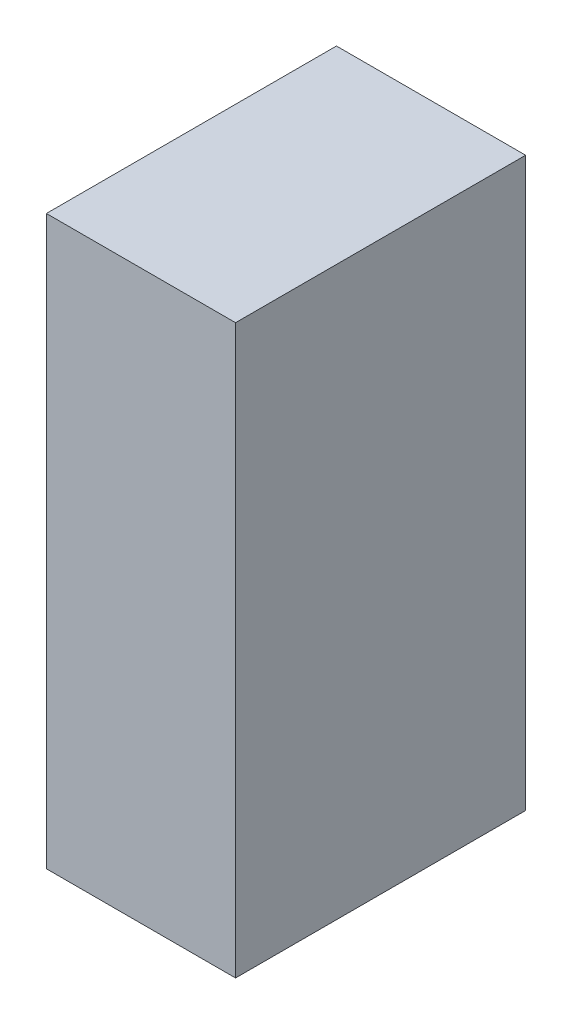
ISO-10303-21;
HEADER;
FILE_DESCRIPTION(('STEP AP214'),'2;1');
FILE_NAME('part.step','',(''),(''),'','','');
FILE_SCHEMA(('AUTOMOTIVE_DESIGN { 1 0 10303 214 1 1 1 1 }'));
ENDSEC;
DATA;
#1=APPLICATION_CONTEXT('core data for automotive mechanical design processes');
#2=APPLICATION_PROTOCOL_DEFINITION('international standard','automotive_design',2000,#1);
#3=PRODUCT_CONTEXT('',#1,'mechanical');
#4=PRODUCT('Part','Part','',(#3));
#5=PRODUCT_RELATED_PRODUCT_CATEGORY('part','',(#4));
#6=PRODUCT_DEFINITION_FORMATION('','',#4);
#7=PRODUCT_DEFINITION_CONTEXT('part definition',#1,'design');
#8=PRODUCT_DEFINITION('design','',#6,#7);
#9=PRODUCT_DEFINITION_SHAPE('','',#8);
#10=(LENGTH_UNIT() NAMED_UNIT(*) SI_UNIT(.MILLI.,.METRE.));
#11=(NAMED_UNIT(*) PLANE_ANGLE_UNIT() SI_UNIT($,.RADIAN.));
#12=(NAMED_UNIT(*) SI_UNIT($,.STERADIAN.) SOLID_ANGLE_UNIT());
#13=UNCERTAINTY_MEASURE_WITH_UNIT(LENGTH_MEASURE(1.E-05),#10,'distance_accuracy_value','');
#14=(GEOMETRIC_REPRESENTATION_CONTEXT(3) GLOBAL_UNCERTAINTY_ASSIGNED_CONTEXT((#13)) GLOBAL_UNIT_ASSIGNED_CONTEXT((#10,
#11,#12)) REPRESENTATION_CONTEXT('',''));
#15=CARTESIAN_POINT('',(0.,0.,0.));
#16=DIRECTION('',(0.,0.,1.));
#17=DIRECTION('',(1.,0.,0.));
#18=AXIS2_PLACEMENT_3D('',#15,#16,#17);
#19=CARTESIAN_POINT('',(0.15000224,-0.4499991,0.));
#20=DIRECTION('',(-1.,0.,0.));
#21=DIRECTION('',(0.,0.,1.));
#22=AXIS2_PLACEMENT_3D('',#19,#20,#21);
#23=PLANE('',#22);
#24=DIRECTION('',(0.,0.,-1.));
#25=VECTOR('',#24,1.);
#26=CARTESIAN_POINT('',(0.15000224,0.4499991,0.));
#27=LINE('',#26,#25);
#28=CARTESIAN_POINT('',(0.15000224,0.4499991,0.));
#29=VERTEX_POINT('',#28);
#30=CARTESIAN_POINT('',(0.15000224,0.4499991,0.45999908));
#31=VERTEX_POINT('',#30);
#32=EDGE_CURVE('E19',#29,#31,#27,.F.);
#33=ORIENTED_EDGE('',*,*,#32,.T.);
#34=DIRECTION('',(0.,1.,0.));
#35=VECTOR('',#34,1.);
#36=CARTESIAN_POINT('',(0.15000224,0.4499991,0.45999908));
#37=LINE('',#36,#35);
#38=CARTESIAN_POINT('',(0.15000224,-0.4499991,0.45999908));
#39=VERTEX_POINT('',#38);
#40=EDGE_CURVE('E54',#31,#39,#37,.F.);
#41=ORIENTED_EDGE('',*,*,#40,.T.);
#42=DIRECTION('',(0.,0.,1.));
#43=VECTOR('',#42,1.);
#44=CARTESIAN_POINT('',(0.15000224,-0.4499991,0.));
#45=LINE('',#44,#43);
#46=CARTESIAN_POINT('',(0.15000224,-0.4499991,0.));
#47=VERTEX_POINT('',#46);
#48=EDGE_CURVE('E75',#39,#47,#45,.F.);
#49=ORIENTED_EDGE('',*,*,#48,.T.);
#50=DIRECTION('',(0.,1.,0.));
#51=VECTOR('',#50,1.);
#52=CARTESIAN_POINT('',(0.15000224,0.4499991,0.));
#53=LINE('',#52,#51);
#54=EDGE_CURVE('E57',#29,#47,#53,.F.);
#55=ORIENTED_EDGE('',*,*,#54,.F.);
#56=EDGE_LOOP('',(#33,#41,#49,#55));
#57=FACE_BOUND('',#56,.T.);
#58=ADVANCED_FACE('F16',(#57),#23,.F.);
#59=CARTESIAN_POINT('',(0.15000224,0.4499991,0.));
#60=DIRECTION('',(0.,-1.,0.));
#61=DIRECTION('',(0.,0.,-1.));
#62=AXIS2_PLACEMENT_3D('',#59,#60,#61);
#63=PLANE('',#62);
#64=DIRECTION('',(0.,0.,-1.));
#65=VECTOR('',#64,1.);
#66=CARTESIAN_POINT('',(-0.1499997,0.4499991,0.));
#67=LINE('',#66,#65);
#68=CARTESIAN_POINT('',(-0.1499997,0.4499991,0.));
#69=VERTEX_POINT('',#68);
#70=CARTESIAN_POINT('',(-0.1499997,0.4499991,0.45999908));
#71=VERTEX_POINT('',#70);
#72=EDGE_CURVE('E72',#69,#71,#67,.F.);
#73=ORIENTED_EDGE('',*,*,#72,.T.);
#74=DIRECTION('',(-1.,0.,0.));
#75=VECTOR('',#74,1.);
#76=CARTESIAN_POINT('',(-0.1499997,0.4499991,0.45999908));
#77=LINE('',#76,#75);
#78=EDGE_CURVE('E62',#71,#31,#77,.F.);
#79=ORIENTED_EDGE('',*,*,#78,.T.);
#80=ORIENTED_EDGE('',*,*,#32,.F.);
#81=DIRECTION('',(-1.,0.,0.));
#82=VECTOR('',#81,1.);
#83=CARTESIAN_POINT('',(-0.1499997,0.4499991,0.));
#84=LINE('',#83,#82);
#85=EDGE_CURVE('E77',#69,#29,#84,.F.);
#86=ORIENTED_EDGE('',*,*,#85,.F.);
#87=EDGE_LOOP('',(#73,#79,#80,#86));
#88=FACE_BOUND('',#87,.T.);
#89=ADVANCED_FACE('F71',(#88),#63,.F.);
#90=CARTESIAN_POINT('',(-0.1499997,0.4499991,0.45999908));
#91=DIRECTION('',(0.,0.,-1.));
#92=DIRECTION('',(-1.,0.,0.));
#93=AXIS2_PLACEMENT_3D('',#90,#91,#92);
#94=PLANE('',#93);
#95=DIRECTION('',(1.,0.,0.));
#96=VECTOR('',#95,1.);
#97=CARTESIAN_POINT('',(-0.1499997,-0.4499991,0.45999908));
#98=LINE('',#97,#96);
#99=CARTESIAN_POINT('',(-0.1499997,-0.4499991,0.45999908));
#100=VERTEX_POINT('',#99);
#101=EDGE_CURVE('E68',#100,#39,#98,.T.);
#102=ORIENTED_EDGE('',*,*,#101,.T.);
#103=ORIENTED_EDGE('',*,*,#40,.F.);
#104=ORIENTED_EDGE('',*,*,#78,.F.);
#105=DIRECTION('',(0.,1.,0.));
#106=VECTOR('',#105,1.);
#107=CARTESIAN_POINT('',(-0.1499997,0.4499991,0.45999908));
#108=LINE('',#107,#106);
#109=EDGE_CURVE('E82',#71,#100,#108,.F.);
#110=ORIENTED_EDGE('',*,*,#109,.T.);
#111=EDGE_LOOP('',(#102,#103,#104,#110));
#112=FACE_BOUND('',#111,.T.);
#113=ADVANCED_FACE('F65',(#112),#94,.F.);
#114=CARTESIAN_POINT('',(-0.1499997,-0.4499991,0.));
#115=DIRECTION('',(0.,1.,0.));
#116=DIRECTION('',(0.,0.,1.));
#117=AXIS2_PLACEMENT_3D('',#114,#115,#116);
#118=PLANE('',#117);
#119=ORIENTED_EDGE('',*,*,#48,.F.);
#120=ORIENTED_EDGE('',*,*,#101,.F.);
#121=DIRECTION('',(0.,0.,-1.));
#122=VECTOR('',#121,1.);
#123=CARTESIAN_POINT('',(-0.1499997,-0.4499991,0.));
#124=LINE('',#123,#122);
#125=CARTESIAN_POINT('',(-0.1499997,-0.4499991,0.));
#126=VERTEX_POINT('',#125);
#127=EDGE_CURVE('E25',#100,#126,#124,.T.);
#128=ORIENTED_EDGE('',*,*,#127,.T.);
#129=DIRECTION('',(-1.,0.,0.));
#130=VECTOR('',#129,1.);
#131=CARTESIAN_POINT('',(-0.1499997,-0.4499991,0.));
#132=LINE('',#131,#130);
#133=EDGE_CURVE('E33',#47,#126,#132,.T.);
#134=ORIENTED_EDGE('',*,*,#133,.F.);
#135=EDGE_LOOP('',(#119,#120,#128,#134));
#136=FACE_BOUND('',#135,.T.);
#137=ADVANCED_FACE('F87',(#136),#118,.F.);
#138=CARTESIAN_POINT('',(-0.1499997,0.4499991,0.));
#139=DIRECTION('',(0.,0.,-1.));
#140=DIRECTION('',(-1.,0.,0.));
#141=AXIS2_PLACEMENT_3D('',#138,#139,#140);
#142=PLANE('',#141);
#143=ORIENTED_EDGE('',*,*,#133,.T.);
#144=DIRECTION('',(0.,1.,0.));
#145=VECTOR('',#144,1.);
#146=CARTESIAN_POINT('',(-0.1499997,0.4499991,0.));
#147=LINE('',#146,#145);
#148=EDGE_CURVE('E11',#126,#69,#147,.T.);
#149=ORIENTED_EDGE('',*,*,#148,.T.);
#150=ORIENTED_EDGE('',*,*,#85,.T.);
#151=ORIENTED_EDGE('',*,*,#54,.T.);
#152=EDGE_LOOP('',(#143,#149,#150,#151));
#153=FACE_BOUND('',#152,.T.);
#154=ADVANCED_FACE('F90',(#153),#142,.T.);
#155=CARTESIAN_POINT('',(-0.1499997,0.4499991,0.));
#156=DIRECTION('',(1.,0.,0.));
#157=DIRECTION('',(0.,0.,-1.));
#158=AXIS2_PLACEMENT_3D('',#155,#156,#157);
#159=PLANE('',#158);
#160=ORIENTED_EDGE('',*,*,#127,.F.);
#161=ORIENTED_EDGE('',*,*,#109,.F.);
#162=ORIENTED_EDGE('',*,*,#72,.F.);
#163=ORIENTED_EDGE('',*,*,#148,.F.);
#164=EDGE_LOOP('',(#160,#161,#162,#163));
#165=FACE_BOUND('',#164,.T.);
#166=ADVANCED_FACE('F89',(#165),#159,.F.);
#167=CLOSED_SHELL('',(#58,#89,#113,#137,#154,#166));
#168=MANIFOLD_SOLID_BREP('B1',#167);
#169=ADVANCED_BREP_SHAPE_REPRESENTATION('',(#18,#168),#14);
#170=SHAPE_DEFINITION_REPRESENTATION(#9,#169);
ENDSEC;
END-ISO-10303-21;
